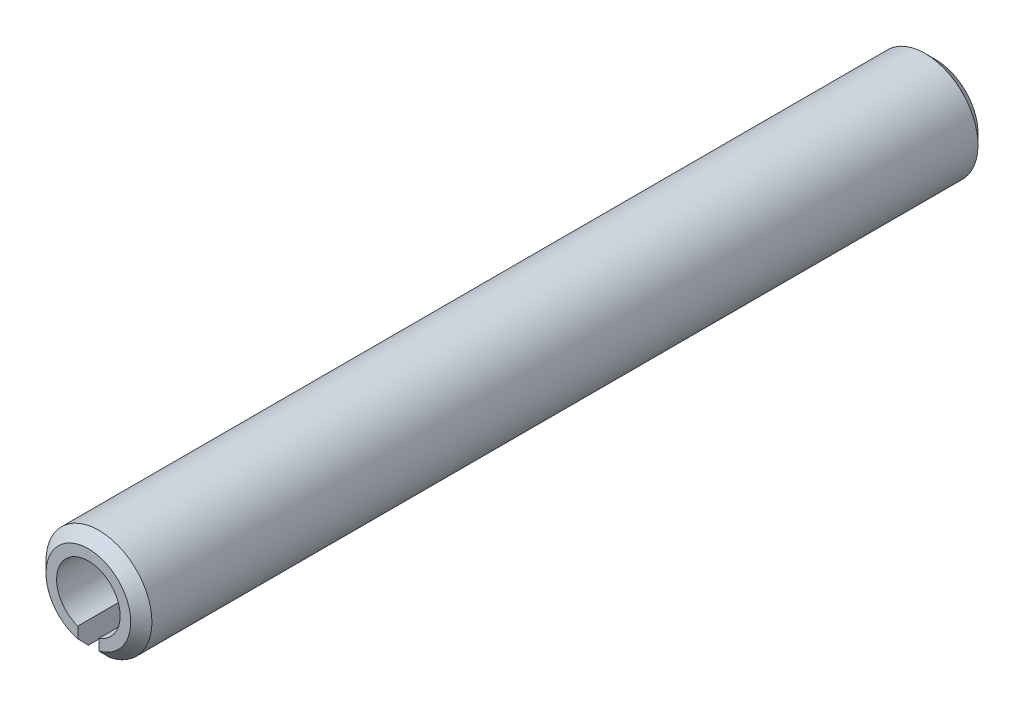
ISO-10303-21;
HEADER;
FILE_DESCRIPTION(('STEP AP214'),'2;1');
FILE_NAME('part.step','',(''),(''),'','','');
FILE_SCHEMA(('AUTOMOTIVE_DESIGN { 1 0 10303 214 1 1 1 1 }'));
ENDSEC;
DATA;
#1=APPLICATION_CONTEXT('core data for automotive mechanical design processes');
#2=APPLICATION_PROTOCOL_DEFINITION('international standard','automotive_design',2000,#1);
#3=PRODUCT_CONTEXT('',#1,'mechanical');
#4=PRODUCT('Part','Part','',(#3));
#5=PRODUCT_RELATED_PRODUCT_CATEGORY('part','',(#4));
#6=PRODUCT_DEFINITION_FORMATION('','',#4);
#7=PRODUCT_DEFINITION_CONTEXT('part definition',#1,'design');
#8=PRODUCT_DEFINITION('design','',#6,#7);
#9=PRODUCT_DEFINITION_SHAPE('','',#8);
#10=(LENGTH_UNIT() NAMED_UNIT(*) SI_UNIT(.MILLI.,.METRE.));
#11=(NAMED_UNIT(*) PLANE_ANGLE_UNIT() SI_UNIT($,.RADIAN.));
#12=(NAMED_UNIT(*) SI_UNIT($,.STERADIAN.) SOLID_ANGLE_UNIT());
#13=UNCERTAINTY_MEASURE_WITH_UNIT(LENGTH_MEASURE(1.E-05),#10,'distance_accuracy_value','');
#14=(GEOMETRIC_REPRESENTATION_CONTEXT(3) GLOBAL_UNCERTAINTY_ASSIGNED_CONTEXT((#13)) GLOBAL_UNIT_ASSIGNED_CONTEXT((#10,
#11,#12)) REPRESENTATION_CONTEXT('',''));
#15=CARTESIAN_POINT('',(0.,0.,0.));
#16=DIRECTION('',(0.,0.,1.));
#17=DIRECTION('',(1.,0.,0.));
#18=AXIS2_PLACEMENT_3D('',#15,#16,#17);
#19=CARTESIAN_POINT('',(0.,0.,40.));
#20=DIRECTION('',(0.,0.,-1.));
#21=DIRECTION('',(-1.,0.,0.));
#22=AXIS2_PLACEMENT_3D('',#19,#20,#21);
#23=CYLINDRICAL_SURFACE('',#22,1.5);
#24=CARTESIAN_POINT('',(0.,0.,0.));
#25=DIRECTION('',(0.,0.,-1.));
#26=DIRECTION('',(1.,0.,0.));
#27=AXIS2_PLACEMENT_3D('',#24,#25,#26);
#28=CIRCLE('',#27,1.5);
#29=CARTESIAN_POINT('',(-0.5,-1.41421356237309,0.));
#30=VERTEX_POINT('',#29);
#31=CARTESIAN_POINT('',(0.5,-1.41421356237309,0.));
#32=VERTEX_POINT('',#31);
#33=EDGE_CURVE('E87',#30,#32,#28,.T.);
#34=ORIENTED_EDGE('',*,*,#33,.T.);
#35=DIRECTION('',(0.,0.,-1.));
#36=VECTOR('',#35,1.);
#37=CARTESIAN_POINT('',(0.5,-1.41421356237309,40.));
#38=LINE('',#37,#36);
#39=CARTESIAN_POINT('',(0.5,-1.41421356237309,40.));
#40=VERTEX_POINT('',#39);
#41=EDGE_CURVE('E92',#40,#32,#38,.T.);
#42=ORIENTED_EDGE('',*,*,#41,.F.);
#43=CARTESIAN_POINT('',(0.,0.,40.));
#44=DIRECTION('',(0.,0.,-1.));
#45=DIRECTION('',(1.,0.,0.));
#46=AXIS2_PLACEMENT_3D('',#43,#44,#45);
#47=CIRCLE('',#46,1.5);
#48=CARTESIAN_POINT('',(-0.5,-1.41421356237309,40.));
#49=VERTEX_POINT('',#48);
#50=EDGE_CURVE('E107',#49,#40,#47,.T.);
#51=ORIENTED_EDGE('',*,*,#50,.F.);
#52=DIRECTION('',(0.,0.,-1.));
#53=VECTOR('',#52,1.);
#54=CARTESIAN_POINT('',(-0.5,-1.41421356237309,40.));
#55=LINE('',#54,#53);
#56=EDGE_CURVE('E103',#49,#30,#55,.T.);
#57=ORIENTED_EDGE('',*,*,#56,.T.);
#58=EDGE_LOOP('',(#34,#42,#51,#57));
#59=FACE_BOUND('',#58,.T.);
#60=ADVANCED_FACE('F31',(#59),#23,.F.);
#61=CARTESIAN_POINT('',(0.5,-1.41421356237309,40.));
#62=DIRECTION('',(1.,0.,0.));
#63=DIRECTION('',(0.,1.,0.));
#64=AXIS2_PLACEMENT_3D('',#61,#62,#63);
#65=PLANE('',#64);
#66=DIRECTION('',(0.,-1.,0.));
#67=VECTOR('',#66,1.);
#68=CARTESIAN_POINT('',(0.5,-1.41421356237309,0.));
#69=LINE('',#68,#67);
#70=CARTESIAN_POINT('',(0.5,-1.9364916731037,0.));
#71=VERTEX_POINT('',#70);
#72=EDGE_CURVE('E83',#32,#71,#69,.T.);
#73=ORIENTED_EDGE('',*,*,#72,.T.);
#74=CARTESIAN_POINT('',(0.5,-1.9364916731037,0.));
#75=CARTESIAN_POINT('',(0.5,-1.97937842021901,0.0415260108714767));
#76=CARTESIAN_POINT('',(0.5,-2.02222317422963,0.0830953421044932));
#77=CARTESIAN_POINT('',(0.5,-2.10784071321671,0.166307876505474));
#78=CARTESIAN_POINT('',(0.5,-2.15061349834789,0.207951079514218));
#79=CARTESIAN_POINT('',(0.5,-2.23609927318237,0.291298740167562));
#80=CARTESIAN_POINT('',(0.5,-2.27881226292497,0.333003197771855));
#81=CARTESIAN_POINT('',(0.5,-2.36418717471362,0.416464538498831));
#82=CARTESIAN_POINT('',(0.5,-2.40684909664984,0.45822142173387));
#83=CARTESIAN_POINT('',(0.5,-2.44948974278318,0.500000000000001));
#84=B_SPLINE_CURVE_WITH_KNOTS('',3,(#74,#75,#76,#77,#78,#79,#80,#81,#82,#83),.UNSPECIFIED.,.F.,
.F.,(4,2,2,2,4),(0.,0.179089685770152,0.358178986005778,0.537268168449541,0.716357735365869),.UNSPECIFIED.);
#85=CARTESIAN_POINT('',(0.5,-2.44948974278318,0.500000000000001));
#86=VERTEX_POINT('',#85);
#87=EDGE_CURVE('E38',#71,#86,#84,.T.);
#88=ORIENTED_EDGE('',*,*,#87,.T.);
#89=DIRECTION('',(0.,0.,-1.));
#90=VECTOR('',#89,1.);
#91=CARTESIAN_POINT('',(0.5,-2.44948974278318,40.));
#92=LINE('',#91,#90);
#93=CARTESIAN_POINT('',(0.5,-2.44948974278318,39.5));
#94=VERTEX_POINT('',#93);
#95=EDGE_CURVE('E99',#94,#86,#92,.T.);
#96=ORIENTED_EDGE('',*,*,#95,.F.);
#97=CARTESIAN_POINT('',(0.5,-2.44948974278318,39.5));
#98=CARTESIAN_POINT('',(0.5,-2.40684909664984,39.5417785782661));
#99=CARTESIAN_POINT('',(0.5,-2.36418717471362,39.5835354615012));
#100=CARTESIAN_POINT('',(0.500000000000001,-2.27881226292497,39.6669968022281));
#101=CARTESIAN_POINT('',(0.5,-2.23609927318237,39.7087012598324));
#102=CARTESIAN_POINT('',(0.5,-2.1506134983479,39.7920489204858));
#103=CARTESIAN_POINT('',(0.5,-2.10784071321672,39.8336921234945));
#104=CARTESIAN_POINT('',(0.5,-2.02222317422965,39.9169046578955));
#105=CARTESIAN_POINT('',(0.5,-1.97937842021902,39.9584739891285));
#106=CARTESIAN_POINT('',(0.5,-1.93649167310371,40.));
#107=B_SPLINE_CURVE_WITH_KNOTS('',3,(#97,#98,#99,#100,#101,#102,#103,#104,#105,#106),
.UNSPECIFIED.,.F.,.F.,(4,2,2,2,4),(0.,0.179089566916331,0.358178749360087,0.537268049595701,
0.716357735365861),.UNSPECIFIED.);
#108=CARTESIAN_POINT('',(0.5,-1.93649167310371,40.));
#109=VERTEX_POINT('',#108);
#110=EDGE_CURVE('E45',#94,#109,#107,.T.);
#111=ORIENTED_EDGE('',*,*,#110,.T.);
#112=DIRECTION('',(0.,-1.,0.));
#113=VECTOR('',#112,1.);
#114=CARTESIAN_POINT('',(0.5,-1.41421356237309,40.));
#115=LINE('',#114,#113);
#116=EDGE_CURVE('E94',#40,#109,#115,.T.);
#117=ORIENTED_EDGE('',*,*,#116,.F.);
#118=ORIENTED_EDGE('',*,*,#41,.T.);
#119=EDGE_LOOP('',(#73,#88,#96,#111,#117,#118));
#120=FACE_BOUND('',#119,.T.);
#121=ADVANCED_FACE('F93',(#120),#65,.F.);
#122=CARTESIAN_POINT('',(0.,0.,40.));
#123=DIRECTION('',(0.,0.,-1.));
#124=DIRECTION('',(-1.,0.,0.));
#125=AXIS2_PLACEMENT_3D('',#122,#123,#124);
#126=CYLINDRICAL_SURFACE('',#125,2.5);
#127=ORIENTED_EDGE('',*,*,#95,.T.);
#128=CARTESIAN_POINT('',(0.,0.,0.5));
#129=DIRECTION('',(0.,0.,1.));
#130=DIRECTION('',(1.,0.,0.));
#131=AXIS2_PLACEMENT_3D('',#128,#129,#130);
#132=CIRCLE('',#131,2.5);
#133=CARTESIAN_POINT('',(-0.5,-2.44948974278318,0.5));
#134=VERTEX_POINT('',#133);
#135=EDGE_CURVE('E119',#86,#134,#132,.T.);
#136=ORIENTED_EDGE('',*,*,#135,.T.);
#137=DIRECTION('',(0.,0.,-1.));
#138=VECTOR('',#137,1.);
#139=CARTESIAN_POINT('',(-0.5,-2.44948974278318,40.));
#140=LINE('',#139,#138);
#141=CARTESIAN_POINT('',(-0.5,-2.44948974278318,39.5));
#142=VERTEX_POINT('',#141);
#143=EDGE_CURVE('E113',#142,#134,#140,.T.);
#144=ORIENTED_EDGE('',*,*,#143,.F.);
#145=CARTESIAN_POINT('',(0.,0.,39.5));
#146=DIRECTION('',(0.,0.,1.));
#147=DIRECTION('',(1.,0.,0.));
#148=AXIS2_PLACEMENT_3D('',#145,#146,#147);
#149=CIRCLE('',#148,2.5);
#150=EDGE_CURVE('E98',#142,#94,#149,.F.);
#151=ORIENTED_EDGE('',*,*,#150,.T.);
#152=EDGE_LOOP('',(#127,#136,#144,#151));
#153=FACE_BOUND('',#152,.T.);
#154=ADVANCED_FACE('F143',(#153),#126,.T.);
#155=CARTESIAN_POINT('',(-0.5,-1.41421356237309,40.));
#156=DIRECTION('',(-1.,0.,0.));
#157=DIRECTION('',(0.,-1.,0.));
#158=AXIS2_PLACEMENT_3D('',#155,#156,#157);
#159=PLANE('',#158);
#160=ORIENTED_EDGE('',*,*,#143,.T.);
#161=CARTESIAN_POINT('',(-0.5,-2.44948974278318,0.5));
#162=CARTESIAN_POINT('',(-0.5,-2.40684909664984,0.45822142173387));
#163=CARTESIAN_POINT('',(-0.5,-2.36418717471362,0.416464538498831));
#164=CARTESIAN_POINT('',(-0.5,-2.27881226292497,0.333003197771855));
#165=CARTESIAN_POINT('',(-0.5,-2.23609927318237,0.291298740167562));
#166=CARTESIAN_POINT('',(-0.5,-2.15061349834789,0.207951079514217));
#167=CARTESIAN_POINT('',(-0.5,-2.10784071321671,0.166307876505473));
#168=CARTESIAN_POINT('',(-0.5,-2.02222317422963,0.0830953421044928));
#169=CARTESIAN_POINT('',(-0.5,-1.97937842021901,0.0415260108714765));
#170=CARTESIAN_POINT('',(-0.5,-1.9364916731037,0.));
#171=B_SPLINE_CURVE_WITH_KNOTS('',3,(#161,#162,#163,#164,#165,#166,#167,#168,#169,#170),
.UNSPECIFIED.,.F.,.F.,(4,2,2,2,4),(0.,0.179089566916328,0.35817874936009,0.537268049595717,
0.716357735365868),.UNSPECIFIED.);
#172=CARTESIAN_POINT('',(-0.5,-1.9364916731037,0.));
#173=VERTEX_POINT('',#172);
#174=EDGE_CURVE('E129',#134,#173,#171,.T.);
#175=ORIENTED_EDGE('',*,*,#174,.T.);
#176=DIRECTION('',(0.,1.,0.));
#177=VECTOR('',#176,1.);
#178=CARTESIAN_POINT('',(-0.5,-1.41421356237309,0.));
#179=LINE('',#178,#177);
#180=EDGE_CURVE('E89',#173,#30,#179,.T.);
#181=ORIENTED_EDGE('',*,*,#180,.T.);
#182=ORIENTED_EDGE('',*,*,#56,.F.);
#183=DIRECTION('',(0.,1.,0.));
#184=VECTOR('',#183,1.);
#185=CARTESIAN_POINT('',(-0.5,-1.41421356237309,40.));
#186=LINE('',#185,#184);
#187=CARTESIAN_POINT('',(-0.5,-1.93649167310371,40.));
#188=VERTEX_POINT('',#187);
#189=EDGE_CURVE('E110',#188,#49,#186,.T.);
#190=ORIENTED_EDGE('',*,*,#189,.F.);
#191=CARTESIAN_POINT('',(-0.5,-1.93649167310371,40.));
#192=CARTESIAN_POINT('',(-0.5,-1.97937842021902,39.9584739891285));
#193=CARTESIAN_POINT('',(-0.5,-2.02222317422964,39.9169046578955));
#194=CARTESIAN_POINT('',(-0.5,-2.10784071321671,39.8336921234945));
#195=CARTESIAN_POINT('',(-0.5,-2.1506134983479,39.7920489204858));
#196=CARTESIAN_POINT('',(-0.5,-2.23609927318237,39.7087012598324));
#197=CARTESIAN_POINT('',(-0.5,-2.27881226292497,39.6669968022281));
#198=CARTESIAN_POINT('',(-0.5,-2.36418717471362,39.5835354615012));
#199=CARTESIAN_POINT('',(-0.5,-2.40684909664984,39.5417785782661));
#200=CARTESIAN_POINT('',(-0.5,-2.44948974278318,39.5));
#201=B_SPLINE_CURVE_WITH_KNOTS('',3,(#191,#192,#193,#194,#195,#196,#197,#198,#199,#200),
.UNSPECIFIED.,.F.,.F.,(4,2,2,2,4),(0.,0.179089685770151,0.358178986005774,0.53726816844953,
0.716357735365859),.UNSPECIFIED.);
#202=EDGE_CURVE('E122',#188,#142,#201,.T.);
#203=ORIENTED_EDGE('',*,*,#202,.T.);
#204=EDGE_LOOP('',(#160,#175,#181,#182,#190,#203));
#205=FACE_BOUND('',#204,.T.);
#206=ADVANCED_FACE('F137',(#205),#159,.F.);
#207=CARTESIAN_POINT('',(0.,0.,40.));
#208=DIRECTION('',(0.,0.,1.));
#209=DIRECTION('',(1.,0.,0.));
#210=AXIS2_PLACEMENT_3D('',#207,#208,#209);
#211=PLANE('',#210);
#212=ORIENTED_EDGE('',*,*,#116,.T.);
#213=CARTESIAN_POINT('',(0.,0.,40.));
#214=DIRECTION('',(0.,0.,1.));
#215=DIRECTION('',(1.,0.,0.));
#216=AXIS2_PLACEMENT_3D('',#213,#214,#215);
#217=CIRCLE('',#216,2.00000000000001);
#218=EDGE_CURVE('E11',#109,#188,#217,.T.);
#219=ORIENTED_EDGE('',*,*,#218,.T.);
#220=ORIENTED_EDGE('',*,*,#189,.T.);
#221=ORIENTED_EDGE('',*,*,#50,.T.);
#222=EDGE_LOOP('',(#212,#219,#220,#221));
#223=FACE_BOUND('',#222,.T.);
#224=ADVANCED_FACE('F142',(#223),#211,.T.);
#225=CARTESIAN_POINT('',(0.,0.,0.));
#226=DIRECTION('',(0.,0.,1.));
#227=DIRECTION('',(1.,0.,0.));
#228=AXIS2_PLACEMENT_3D('',#225,#226,#227);
#229=PLANE('',#228);
#230=ORIENTED_EDGE('',*,*,#180,.F.);
#231=CARTESIAN_POINT('',(0.,0.,0.));
#232=DIRECTION('',(0.,0.,1.));
#233=DIRECTION('',(1.,0.,0.));
#234=AXIS2_PLACEMENT_3D('',#231,#232,#233);
#235=CIRCLE('',#234,1.99999999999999);
#236=EDGE_CURVE('E53',#173,#71,#235,.F.);
#237=ORIENTED_EDGE('',*,*,#236,.T.);
#238=ORIENTED_EDGE('',*,*,#72,.F.);
#239=ORIENTED_EDGE('',*,*,#33,.F.);
#240=EDGE_LOOP('',(#230,#237,#238,#239));
#241=FACE_BOUND('',#240,.T.);
#242=ADVANCED_FACE('F85',(#241),#229,.F.);
#243=CARTESIAN_POINT('',(0.,0.,0.5));
#244=DIRECTION('',(0.,0.,1.));
#245=DIRECTION('',(1.,0.,0.));
#246=AXIS2_PLACEMENT_3D('',#243,#244,#245);
#247=CONICAL_SURFACE('',#246,2.5,0.785398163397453);
#248=ORIENTED_EDGE('',*,*,#87,.F.);
#249=ORIENTED_EDGE('',*,*,#236,.F.);
#250=ORIENTED_EDGE('',*,*,#174,.F.);
#251=ORIENTED_EDGE('',*,*,#135,.F.);
#252=EDGE_LOOP('',(#248,#249,#250,#251));
#253=FACE_BOUND('',#252,.T.);
#254=ADVANCED_FACE('F159',(#253),#247,.T.);
#255=CARTESIAN_POINT('',(0.,0.,40.));
#256=DIRECTION('',(0.,0.,-1.));
#257=DIRECTION('',(-1.,0.,0.));
#258=AXIS2_PLACEMENT_3D('',#255,#256,#257);
#259=CONICAL_SURFACE('',#258,2.00000000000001,0.785398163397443);
#260=ORIENTED_EDGE('',*,*,#110,.F.);
#261=ORIENTED_EDGE('',*,*,#150,.F.);
#262=ORIENTED_EDGE('',*,*,#202,.F.);
#263=ORIENTED_EDGE('',*,*,#218,.F.);
#264=EDGE_LOOP('',(#260,#261,#262,#263));
#265=FACE_BOUND('',#264,.T.);
#266=ADVANCED_FACE('F135',(#265),#259,.T.);
#267=CLOSED_SHELL('',(#60,#121,#154,#206,#224,#242,#254,#266));
#268=MANIFOLD_SOLID_BREP('B2',#267);
#269=ADVANCED_BREP_SHAPE_REPRESENTATION('',(#18,#268),#14);
#270=SHAPE_DEFINITION_REPRESENTATION(#9,#269);
ENDSEC;
END-ISO-10303-21;
